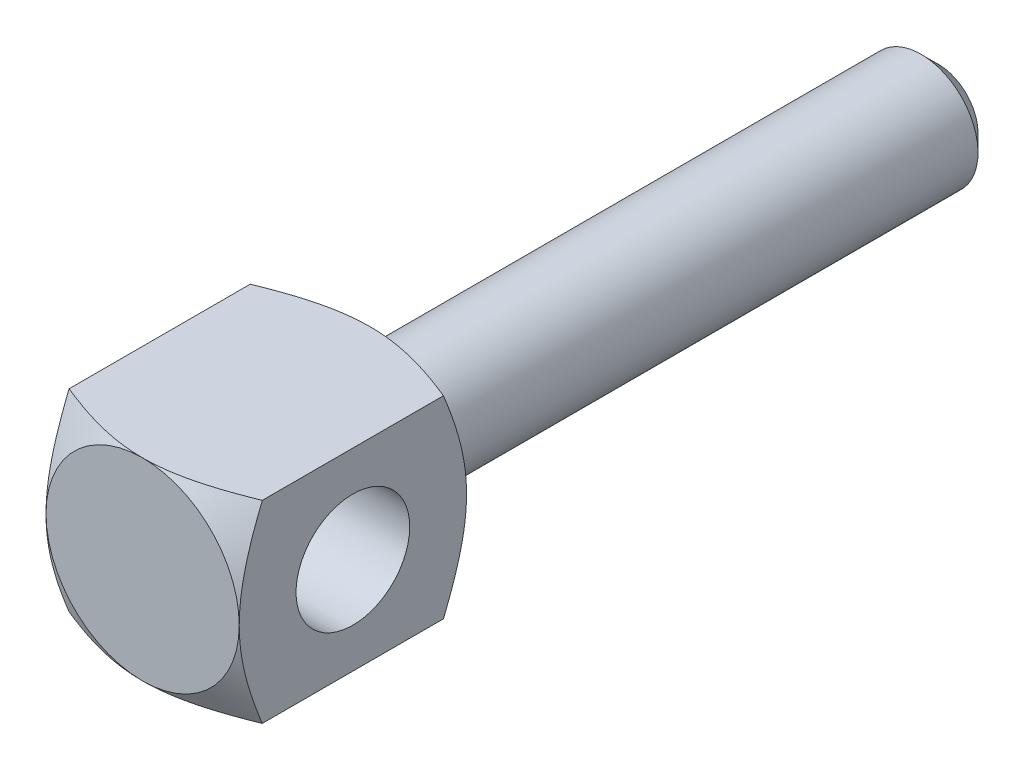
ISO-10303-21;
HEADER;
FILE_DESCRIPTION(('STEP AP214'),'2;1');
FILE_NAME('part.step','',(''),(''),'','','');
FILE_SCHEMA(('AUTOMOTIVE_DESIGN { 1 0 10303 214 1 1 1 1 }'));
ENDSEC;
DATA;
#1=APPLICATION_CONTEXT('core data for automotive mechanical design processes');
#2=APPLICATION_PROTOCOL_DEFINITION('international standard','automotive_design',2000,#1);
#3=PRODUCT_CONTEXT('',#1,'mechanical');
#4=PRODUCT('Part','Part','',(#3));
#5=PRODUCT_RELATED_PRODUCT_CATEGORY('part','',(#4));
#6=PRODUCT_DEFINITION_FORMATION('','',#4);
#7=PRODUCT_DEFINITION_CONTEXT('part definition',#1,'design');
#8=PRODUCT_DEFINITION('design','',#6,#7);
#9=PRODUCT_DEFINITION_SHAPE('','',#8);
#10=(LENGTH_UNIT() NAMED_UNIT(*) SI_UNIT(.MILLI.,.METRE.));
#11=(NAMED_UNIT(*) PLANE_ANGLE_UNIT() SI_UNIT($,.RADIAN.));
#12=(NAMED_UNIT(*) SI_UNIT($,.STERADIAN.) SOLID_ANGLE_UNIT());
#13=UNCERTAINTY_MEASURE_WITH_UNIT(LENGTH_MEASURE(1.E-05),#10,'distance_accuracy_value','');
#14=(GEOMETRIC_REPRESENTATION_CONTEXT(3) GLOBAL_UNCERTAINTY_ASSIGNED_CONTEXT((#13)) GLOBAL_UNIT_ASSIGNED_CONTEXT((#10,
#11,#12)) REPRESENTATION_CONTEXT('',''));
#15=CARTESIAN_POINT('',(0.,0.,0.));
#16=DIRECTION('',(0.,0.,1.));
#17=DIRECTION('',(1.,0.,0.));
#18=AXIS2_PLACEMENT_3D('',#15,#16,#17);
#19=CARTESIAN_POINT('',(0.,-5.,50.));
#20=DIRECTION('',(0.,0.,1.));
#21=DIRECTION('',(0.,-1.,0.));
#22=AXIS2_PLACEMENT_3D('',#19,#20,#21);
#23=PLANE('',#22);
#24=CARTESIAN_POINT('',(0.,0.,50.));
#25=DIRECTION('',(0.,0.,1.));
#26=DIRECTION('',(0.,-1.,0.));
#27=AXIS2_PLACEMENT_3D('',#24,#25,#26);
#28=CIRCLE('',#27,5.);
#29=CARTESIAN_POINT('',(0.,-5.,50.));
#30=VERTEX_POINT('',#29);
#31=EDGE_CURVE('E191',#30,#30,#28,.T.);
#32=ORIENTED_EDGE('',*,*,#31,.T.);
#33=EDGE_LOOP('',(#32));
#34=FACE_BOUND('',#33,.T.);
#35=CARTESIAN_POINT('',(0.,0.,50.));
#36=DIRECTION('',(0.,0.,1.));
#37=DIRECTION('',(0.,-1.,0.));
#38=AXIS2_PLACEMENT_3D('',#35,#36,#37);
#39=CIRCLE('',#38,8.5);
#40=CARTESIAN_POINT('',(0.,-8.5,50.));
#41=VERTEX_POINT('',#40);
#42=CARTESIAN_POINT('',(8.5,0.,50.));
#43=VERTEX_POINT('',#42);
#44=EDGE_CURVE('E82',#41,#43,#39,.T.);
#45=ORIENTED_EDGE('',*,*,#44,.F.);
#46=CARTESIAN_POINT('',(0.,0.,50.));
#47=DIRECTION('',(0.,0.,1.));
#48=DIRECTION('',(0.,-1.,0.));
#49=AXIS2_PLACEMENT_3D('',#46,#47,#48);
#50=CIRCLE('',#49,8.5);
#51=CARTESIAN_POINT('',(-8.5,0.,50.));
#52=VERTEX_POINT('',#51);
#53=EDGE_CURVE('E18',#52,#41,#50,.T.);
#54=ORIENTED_EDGE('',*,*,#53,.F.);
#55=CARTESIAN_POINT('',(0.,8.5,50.));
#56=VERTEX_POINT('',#55);
#57=EDGE_CURVE('E23',#56,#52,#50,.T.);
#58=ORIENTED_EDGE('',*,*,#57,.F.);
#59=EDGE_CURVE('E9',#43,#56,#50,.T.);
#60=ORIENTED_EDGE('',*,*,#59,.F.);
#61=EDGE_LOOP('',(#45,#54,#58,#60));
#62=FACE_BOUND('',#61,.T.);
#63=ADVANCED_FACE('F14',(#34,#62),#23,.F.);
#64=CARTESIAN_POINT('',(0.,0.,0.));
#65=DIRECTION('',(0.,0.,1.));
#66=DIRECTION('',(0.,-1.,0.));
#67=AXIS2_PLACEMENT_3D('',#64,#65,#66);
#68=PLANE('',#67);
#69=CARTESIAN_POINT('',(0.,0.,0.));
#70=DIRECTION('',(0.,0.,1.));
#71=DIRECTION('',(0.,-1.,0.));
#72=AXIS2_PLACEMENT_3D('',#69,#70,#71);
#73=CIRCLE('',#72,3.5);
#74=CARTESIAN_POINT('',(0.,-3.5,0.));
#75=VERTEX_POINT('',#74);
#76=EDGE_CURVE('E197',#75,#75,#73,.T.);
#77=ORIENTED_EDGE('',*,*,#76,.F.);
#78=EDGE_LOOP('',(#77));
#79=FACE_BOUND('',#78,.T.);
#80=ADVANCED_FACE('F16',(#79),#68,.F.);
#81=CARTESIAN_POINT('',(0.,0.,1.5));
#82=DIRECTION('',(0.,0.,1.));
#83=DIRECTION('',(0.,-1.,0.));
#84=AXIS2_PLACEMENT_3D('',#81,#82,#83);
#85=CONICAL_SURFACE('',#84,5.,0.785398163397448);
#86=ORIENTED_EDGE('',*,*,#76,.T.);
#87=EDGE_LOOP('',(#86));
#88=FACE_BOUND('',#87,.T.);
#89=CARTESIAN_POINT('',(0.,0.,1.5));
#90=DIRECTION('',(0.,0.,1.));
#91=DIRECTION('',(0.,-1.,0.));
#92=AXIS2_PLACEMENT_3D('',#89,#90,#91);
#93=CIRCLE('',#92,5.);
#94=CARTESIAN_POINT('',(0.,-5.,1.5));
#95=VERTEX_POINT('',#94);
#96=EDGE_CURVE('E194',#95,#95,#93,.T.);
#97=ORIENTED_EDGE('',*,*,#96,.F.);
#98=EDGE_LOOP('',(#97));
#99=FACE_BOUND('',#98,.T.);
#100=ADVANCED_FACE('F251',(#88,#99),#85,.T.);
#101=CARTESIAN_POINT('',(0.,0.,140.));
#102=DIRECTION('',(0.,0.,1.));
#103=DIRECTION('',(0.,-1.,0.));
#104=AXIS2_PLACEMENT_3D('',#101,#102,#103);
#105=CYLINDRICAL_SURFACE('',#104,5.);
#106=ORIENTED_EDGE('',*,*,#31,.F.);
#107=EDGE_LOOP('',(#106));
#108=FACE_BOUND('',#107,.T.);
#109=ORIENTED_EDGE('',*,*,#96,.T.);
#110=EDGE_LOOP('',(#109));
#111=FACE_BOUND('',#110,.T.);
#112=ADVANCED_FACE('F254',(#108,#111),#105,.T.);
#113=CARTESIAN_POINT('',(0.,0.,56.3709168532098));
#114=DIRECTION('',(0.,0.,1.));
#115=DIRECTION('',(0.,-1.,0.));
#116=AXIS2_PLACEMENT_3D('',#113,#114,#115);
#117=CONICAL_SURFACE('',#116,19.5347516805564,1.0471975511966);
#118=CARTESIAN_POINT('',(-16.9581422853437,-8.5,56.0443656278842));
#119=CARTESIAN_POINT('',(-16.5439778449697,-8.5,55.8306305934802));
#120=CARTESIAN_POINT('',(-16.1291936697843,-8.5,55.6180848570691));
#121=CARTESIAN_POINT('',(-15.2980643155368,-8.5,55.1960059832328));
#122=CARTESIAN_POINT('',(-14.8817190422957,-8.5,54.9864730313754));
#123=CARTESIAN_POINT('',(-14.0462488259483,-8.5,54.5706082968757));
#124=CARTESIAN_POINT('',(-13.6271197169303,-8.5,54.3642848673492));
#125=CARTESIAN_POINT('',(-12.7866363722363,-8.5,53.9562369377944));
#126=CARTESIAN_POINT('',(-12.3652821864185,-8.5,53.7545123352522));
#127=CARTESIAN_POINT('',(-11.4961277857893,-8.5,53.3456810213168));
#128=CARTESIAN_POINT('',(-11.0481703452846,-8.5,53.1389074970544));
#129=CARTESIAN_POINT('',(-10.1484580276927,-8.5,52.7336813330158));
#130=CARTESIAN_POINT('',(-9.69670291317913,-8.5,52.5352292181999));
#131=CARTESIAN_POINT('',(-8.78889276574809,-8.5,52.1494397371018));
#132=CARTESIAN_POINT('',(-8.33284167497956,-8.5,51.9620931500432));
#133=CARTESIAN_POINT('',(-7.41504845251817,-8.5,51.6019911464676));
#134=CARTESIAN_POINT('',(-6.95330722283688,-8.5,51.4292334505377));
#135=CARTESIAN_POINT('',(-6.02814854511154,-8.5,51.1051463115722));
#136=CARTESIAN_POINT('',(-5.56480940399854,-8.5,50.953596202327));
#137=CARTESIAN_POINT('',(-4.63038522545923,-8.5,50.6761276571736));
#138=CARTESIAN_POINT('',(-4.15929996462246,-8.5,50.5502099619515));
#139=CARTESIAN_POINT('',(-3.21846238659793,-8.5,50.3342322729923));
#140=CARTESIAN_POINT('',(-2.74886596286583,-8.5,50.2435159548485));
#141=CARTESIAN_POINT('',(-2.04001869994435,-8.5,50.137633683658));
#142=CARTESIAN_POINT('',(-1.80298698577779,-8.5,50.1073711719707));
#143=CARTESIAN_POINT('',(-1.327800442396,-8.5,50.0576847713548));
#144=CARTESIAN_POINT('',(-1.08964573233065,-8.5,50.0382597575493));
#145=CARTESIAN_POINT('',(-0.560607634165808,-8.5,50.0078316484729));
#146=CARTESIAN_POINT('',(-0.26955993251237,-8.5,49.9995918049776));
#147=CARTESIAN_POINT('',(0.31251560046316,-8.5,50.0004395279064));
#148=CARTESIAN_POINT('',(0.603543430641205,-8.5,50.0095277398));
#149=CARTESIAN_POINT('',(1.18462685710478,-8.5,50.0446201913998));
#150=CARTESIAN_POINT('',(1.47468223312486,-8.5,50.0706280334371));
#151=CARTESIAN_POINT('',(2.05292281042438,-8.5,50.1384551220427));
#152=CARTESIAN_POINT('',(2.34110795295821,-8.5,50.1802748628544));
#153=CARTESIAN_POINT('',(2.92302038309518,-8.5,50.2795128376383));
#154=CARTESIAN_POINT('',(3.216678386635,-8.5,50.3373331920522));
#155=CARTESIAN_POINT('',(3.80108558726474,-8.5,50.4660770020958));
#156=CARTESIAN_POINT('',(4.09183471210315,-8.5,50.5370007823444));
#157=CARTESIAN_POINT('',(4.67048877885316,-8.5,50.6900600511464));
#158=CARTESIAN_POINT('',(4.95839232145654,-8.5,50.7722007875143));
#159=CARTESIAN_POINT('',(5.531309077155,-8.5,50.9458962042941));
#160=CARTESIAN_POINT('',(5.81632245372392,-8.5,51.0374503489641));
#161=CARTESIAN_POINT('',(6.36070030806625,-8.5,51.2206992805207));
#162=CARTESIAN_POINT('',(6.62027208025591,-8.5,51.3117817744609));
#163=CARTESIAN_POINT('',(7.13736946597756,-8.5,51.4995946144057));
#164=CARTESIAN_POINT('',(7.39489498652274,-8.5,51.5963252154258));
#165=CARTESIAN_POINT('',(8.16481717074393,-8.5,51.8937035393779));
#166=CARTESIAN_POINT('',(8.6744526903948,-8.5,52.1015010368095));
#167=CARTESIAN_POINT('',(9.68831599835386,-8.5,52.5310502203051));
#168=CARTESIAN_POINT('',(10.1925381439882,-8.5,52.7528150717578));
#169=CARTESIAN_POINT('',(11.1963099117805,-8.5,53.2065007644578));
#170=CARTESIAN_POINT('',(11.6958600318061,-8.5,53.438420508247));
#171=CARTESIAN_POINT('',(12.6929546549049,-8.5,53.91067923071));
#172=CARTESIAN_POINT('',(13.1904872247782,-8.5,54.1510433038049));
#173=CARTESIAN_POINT('',(14.1826655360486,-8.5,54.6376710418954));
#174=CARTESIAN_POINT('',(14.677311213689,-8.5,54.883934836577));
#175=CARTESIAN_POINT('',(15.664016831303,-8.5,55.3809195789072));
#176=CARTESIAN_POINT('',(16.1560780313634,-8.5,55.6316380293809));
#177=CARTESIAN_POINT('',(17.1383225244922,-8.5,56.1367119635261));
#178=CARTESIAN_POINT('',(17.6285058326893,-8.5,56.3910674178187));
#179=CARTESIAN_POINT('',(18.9648231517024,-8.5,57.0895296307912));
#180=CARTESIAN_POINT('',(19.809440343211,-8.5,57.5365370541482));
#181=CARTESIAN_POINT('',(21.4955238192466,-8.5,58.4367490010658));
#182=CARTESIAN_POINT('',(22.3369895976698,-8.5,58.8899544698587));
#183=CARTESIAN_POINT('',(24.0118407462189,-8.5,59.7978046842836));
#184=CARTESIAN_POINT('',(24.8452424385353,-8.5,60.2524193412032));
#185=CARTESIAN_POINT('',(26.0938942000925,-8.5,60.9368101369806));
#186=CARTESIAN_POINT('',(26.5098330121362,-8.5,61.1653315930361));
#187=CARTESIAN_POINT('',(27.3413032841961,-8.5,61.6231128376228));
#188=CARTESIAN_POINT('',(27.7568347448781,-8.5,61.8523726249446));
#189=CARTESIAN_POINT('',(28.1721890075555,-8.5,62.0819530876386));
#190=B_SPLINE_CURVE_WITH_KNOTS('',3,(#118,#119,#120,#121,#122,#123,#124,#125,#126,#127,#128,
#129,#130,#131,#132,#133,#134,#135,#136,#137,#138,#139,#140,#141,#142,#143,#144,#145,#146,#147,
#148,#149,#150,#151,#152,#153,#154,#155,#156,#157,#158,#159,#160,#161,#162,#163,#164,#165,#166,
#167,#168,#169,#170,#171,#172,#173,#174,#175,#176,#177,#178,#179,#180,#181,#182,#183,#184,#185,
#186,#187,#188,#189),.UNSPECIFIED.,.F.,.F.,(4,2,2,2,2,2,2,2,2,2,2,2,2,2,2,2,2,2,2,2,2,2,2,2,2,2,
2,2,2,2,2,2,2,2,2,4),(0.,1.39819541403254,2.79647658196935,4.19793412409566,5.59936039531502,
7.07942729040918,8.55958741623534,10.0385008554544,11.517182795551,12.9791061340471,
14.4410717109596,15.8742935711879,16.5909475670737,17.307527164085,18.1804958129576,
19.0534969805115,19.9266840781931,20.7998984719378,21.6974410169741,22.5950058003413,
23.4929919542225,24.390927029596,25.2161165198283,26.0413432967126,27.6921353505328,
29.344507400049,30.9967013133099,32.6543082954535,34.3119517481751,35.9686935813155,
37.6254220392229,40.4922165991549,43.3594533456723,46.2074410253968,47.6311835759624,
49.0549237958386),.UNSPECIFIED.);
#191=CARTESIAN_POINT('',(-8.5,-8.5,52.0327436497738));
#192=VERTEX_POINT('',#191);
#193=EDGE_CURVE('E89',#41,#192,#190,.F.);
#194=ORIENTED_EDGE('',*,*,#193,.T.);
#195=CARTESIAN_POINT('',(-8.5,16.9581422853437,56.0443656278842));
#196=CARTESIAN_POINT('',(-8.5,16.5439778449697,55.8306305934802));
#197=CARTESIAN_POINT('',(-8.5,16.1291936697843,55.6180848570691));
#198=CARTESIAN_POINT('',(-8.5,15.2980643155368,55.1960059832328));
#199=CARTESIAN_POINT('',(-8.5,14.8817190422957,54.9864730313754));
#200=CARTESIAN_POINT('',(-8.5,14.0462488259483,54.5706082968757));
#201=CARTESIAN_POINT('',(-8.5,13.6271197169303,54.3642848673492));
#202=CARTESIAN_POINT('',(-8.5,12.7866363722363,53.9562369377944));
#203=CARTESIAN_POINT('',(-8.5,12.3652821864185,53.7545123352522));
#204=CARTESIAN_POINT('',(-8.5,11.4961277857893,53.3456810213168));
#205=CARTESIAN_POINT('',(-8.5,11.0481703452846,53.1389074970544));
#206=CARTESIAN_POINT('',(-8.5,10.1484580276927,52.7336813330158));
#207=CARTESIAN_POINT('',(-8.5,9.69670291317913,52.5352292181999));
#208=CARTESIAN_POINT('',(-8.5,8.78889276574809,52.1494397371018));
#209=CARTESIAN_POINT('',(-8.5,8.33284167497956,51.9620931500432));
#210=CARTESIAN_POINT('',(-8.5,7.41504845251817,51.6019911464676));
#211=CARTESIAN_POINT('',(-8.5,6.95330722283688,51.4292334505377));
#212=CARTESIAN_POINT('',(-8.5,6.02814854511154,51.1051463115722));
#213=CARTESIAN_POINT('',(-8.5,5.56480940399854,50.953596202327));
#214=CARTESIAN_POINT('',(-8.5,4.63038522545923,50.6761276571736));
#215=CARTESIAN_POINT('',(-8.5,4.15929996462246,50.5502099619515));
#216=CARTESIAN_POINT('',(-8.5,3.21846238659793,50.3342322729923));
#217=CARTESIAN_POINT('',(-8.5,2.74886596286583,50.2435159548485));
#218=CARTESIAN_POINT('',(-8.5,2.04001869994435,50.137633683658));
#219=CARTESIAN_POINT('',(-8.5,1.80298698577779,50.1073711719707));
#220=CARTESIAN_POINT('',(-8.5,1.327800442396,50.0576847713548));
#221=CARTESIAN_POINT('',(-8.5,1.08964573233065,50.0382597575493));
#222=CARTESIAN_POINT('',(-8.5,0.560607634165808,50.0078316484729));
#223=CARTESIAN_POINT('',(-8.5,0.26955993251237,49.9995918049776));
#224=CARTESIAN_POINT('',(-8.5,-0.31251560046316,50.0004395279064));
#225=CARTESIAN_POINT('',(-8.5,-0.603543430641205,50.0095277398));
#226=CARTESIAN_POINT('',(-8.5,-1.18462685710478,50.0446201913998));
#227=CARTESIAN_POINT('',(-8.5,-1.47468223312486,50.0706280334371));
#228=CARTESIAN_POINT('',(-8.5,-2.05292281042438,50.1384551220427));
#229=CARTESIAN_POINT('',(-8.5,-2.34110795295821,50.1802748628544));
#230=CARTESIAN_POINT('',(-8.5,-2.92302038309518,50.2795128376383));
#231=CARTESIAN_POINT('',(-8.5,-3.216678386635,50.3373331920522));
#232=CARTESIAN_POINT('',(-8.5,-3.80108558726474,50.4660770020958));
#233=CARTESIAN_POINT('',(-8.5,-4.09183471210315,50.5370007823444));
#234=CARTESIAN_POINT('',(-8.5,-4.67048877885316,50.6900600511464));
#235=CARTESIAN_POINT('',(-8.5,-4.95839232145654,50.7722007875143));
#236=CARTESIAN_POINT('',(-8.5,-5.531309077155,50.9458962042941));
#237=CARTESIAN_POINT('',(-8.5,-5.81632245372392,51.0374503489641));
#238=CARTESIAN_POINT('',(-8.5,-6.36070030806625,51.2206992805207));
#239=CARTESIAN_POINT('',(-8.5,-6.62027208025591,51.3117817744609));
#240=CARTESIAN_POINT('',(-8.5,-7.13736946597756,51.4995946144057));
#241=CARTESIAN_POINT('',(-8.5,-7.39489498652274,51.5963252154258));
#242=CARTESIAN_POINT('',(-8.5,-8.16481717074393,51.8937035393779));
#243=CARTESIAN_POINT('',(-8.5,-8.6744526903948,52.1015010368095));
#244=CARTESIAN_POINT('',(-8.5,-9.68831599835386,52.5310502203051));
#245=CARTESIAN_POINT('',(-8.5,-10.1925381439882,52.7528150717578));
#246=CARTESIAN_POINT('',(-8.5,-11.1963099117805,53.2065007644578));
#247=CARTESIAN_POINT('',(-8.5,-11.6958600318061,53.438420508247));
#248=CARTESIAN_POINT('',(-8.5,-12.6929546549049,53.91067923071));
#249=CARTESIAN_POINT('',(-8.5,-13.1904872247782,54.1510433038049));
#250=CARTESIAN_POINT('',(-8.5,-14.1826655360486,54.6376710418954));
#251=CARTESIAN_POINT('',(-8.5,-14.677311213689,54.883934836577));
#252=CARTESIAN_POINT('',(-8.5,-15.664016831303,55.3809195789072));
#253=CARTESIAN_POINT('',(-8.5,-16.1560780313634,55.6316380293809));
#254=CARTESIAN_POINT('',(-8.5,-17.1383225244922,56.1367119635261));
#255=CARTESIAN_POINT('',(-8.5,-17.6285058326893,56.3910674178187));
#256=CARTESIAN_POINT('',(-8.5,-18.9648231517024,57.0895296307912));
#257=CARTESIAN_POINT('',(-8.5,-19.809440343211,57.5365370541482));
#258=CARTESIAN_POINT('',(-8.5,-21.4955238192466,58.4367490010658));
#259=CARTESIAN_POINT('',(-8.5,-22.3369895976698,58.8899544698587));
#260=CARTESIAN_POINT('',(-8.5,-24.0118407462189,59.7978046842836));
#261=CARTESIAN_POINT('',(-8.5,-24.8452424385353,60.2524193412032));
#262=CARTESIAN_POINT('',(-8.5,-26.0938942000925,60.9368101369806));
#263=CARTESIAN_POINT('',(-8.5,-26.5098330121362,61.1653315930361));
#264=CARTESIAN_POINT('',(-8.5,-27.3413032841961,61.6231128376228));
#265=CARTESIAN_POINT('',(-8.5,-27.7568347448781,61.8523726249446));
#266=CARTESIAN_POINT('',(-8.5,-28.1721890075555,62.0819530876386));
#267=B_SPLINE_CURVE_WITH_KNOTS('',3,(#195,#196,#197,#198,#199,#200,#201,#202,#203,#204,#205,
#206,#207,#208,#209,#210,#211,#212,#213,#214,#215,#216,#217,#218,#219,#220,#221,#222,#223,#224,
#225,#226,#227,#228,#229,#230,#231,#232,#233,#234,#235,#236,#237,#238,#239,#240,#241,#242,#243,
#244,#245,#246,#247,#248,#249,#250,#251,#252,#253,#254,#255,#256,#257,#258,#259,#260,#261,#262,
#263,#264,#265,#266),.UNSPECIFIED.,.F.,.F.,(4,2,2,2,2,2,2,2,2,2,2,2,2,2,2,2,2,2,2,2,2,2,2,2,2,2,
2,2,2,2,2,2,2,2,2,4),(0.,1.39819541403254,2.79647658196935,4.19793412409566,5.59936039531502,
7.07942729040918,8.55958741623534,10.0385008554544,11.517182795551,12.9791061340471,
14.4410717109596,15.8742935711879,16.5909475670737,17.307527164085,18.1804958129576,
19.0534969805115,19.9266840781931,20.7998984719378,21.6974410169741,22.5950058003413,
23.4929919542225,24.390927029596,25.2161165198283,26.0413432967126,27.6921353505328,
29.344507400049,30.9967013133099,32.6543082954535,34.3119517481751,35.9686935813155,
37.6254220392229,40.4922165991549,43.3594533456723,46.2074410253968,47.6311835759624,
49.0549237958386),.UNSPECIFIED.);
#268=EDGE_CURVE('E96',#52,#192,#267,.T.);
#269=ORIENTED_EDGE('',*,*,#268,.F.);
#270=ORIENTED_EDGE('',*,*,#53,.T.);
#271=EDGE_LOOP('',(#194,#269,#270));
#272=FACE_BOUND('',#271,.T.);
#273=ADVANCED_FACE('F94',(#272),#117,.T.);
#274=ORIENTED_EDGE('',*,*,#57,.T.);
#275=CARTESIAN_POINT('',(-8.5,8.5,52.0327436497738));
#276=VERTEX_POINT('',#275);
#277=EDGE_CURVE('E106',#276,#52,#267,.T.);
#278=ORIENTED_EDGE('',*,*,#277,.F.);
#279=CARTESIAN_POINT('',(-16.9581422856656,8.5,56.0443656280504));
#280=CARTESIAN_POINT('',(-16.5439778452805,8.5,55.8306305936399));
#281=CARTESIAN_POINT('',(-16.129193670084,8.5,55.6180848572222));
#282=CARTESIAN_POINT('',(-15.2980643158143,8.5,55.1960059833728));
#283=CARTESIAN_POINT('',(-14.881719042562,8.5,54.9864730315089));
#284=CARTESIAN_POINT('',(-14.0462488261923,8.5,54.5706082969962));
#285=CARTESIAN_POINT('',(-13.6271197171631,8.5,54.3642848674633));
#286=CARTESIAN_POINT('',(-12.7866363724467,8.5,53.9562369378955));
#287=CARTESIAN_POINT('',(-12.3652821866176,8.5,53.7545123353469));
#288=CARTESIAN_POINT('',(-11.4961277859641,8.5,53.3456810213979));
#289=CARTESIAN_POINT('',(-11.0481703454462,8.5,53.1389074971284));
#290=CARTESIAN_POINT('',(-10.1484580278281,8.5,52.7336813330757));
#291=CARTESIAN_POINT('',(-9.69670291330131,8.5,52.5352292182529));
#292=CARTESIAN_POINT('',(-8.78889276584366,8.5,52.1494397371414));
#293=CARTESIAN_POINT('',(-8.33284167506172,8.5,51.9620931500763));
#294=CARTESIAN_POINT('',(-7.41504845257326,8.5,51.6019911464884));
#295=CARTESIAN_POINT('',(-6.95330722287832,8.5,51.4292334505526));
#296=CARTESIAN_POINT('',(-6.0281485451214,8.5,51.1051463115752));
#297=CARTESIAN_POINT('',(-5.56480940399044,8.5,50.9535962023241));
#298=CARTESIAN_POINT('',(-4.63038522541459,8.5,50.6761276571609));
#299=CARTESIAN_POINT('',(-4.15929996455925,8.5,50.550209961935));
#300=CARTESIAN_POINT('',(-3.21846238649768,8.5,50.3342322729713));
#301=CARTESIAN_POINT('',(-2.74886596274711,8.5,50.2435159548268));
#302=CARTESIAN_POINT('',(-2.04001869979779,8.5,50.1376336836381));
#303=CARTESIAN_POINT('',(-1.80298698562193,8.5,50.1073711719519));
#304=CARTESIAN_POINT('',(-1.32780044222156,8.5,50.0576847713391));
#305=CARTESIAN_POINT('',(-1.08964573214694,8.5,50.0382597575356));
#306=CARTESIAN_POINT('',(-0.56060763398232,8.5,50.0078316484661));
#307=CARTESIAN_POINT('',(-0.269559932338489,8.5,49.9995918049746));
#308=CARTESIAN_POINT('',(0.312515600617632,8.5,50.0004395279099));
#309=CARTESIAN_POINT('',(0.603543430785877,8.5,50.0095277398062));
#310=CARTESIAN_POINT('',(1.18462685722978,8.5,50.0446201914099));
#311=CARTESIAN_POINT('',(1.47468223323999,8.5,50.0706280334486));
#312=CARTESIAN_POINT('',(2.05292281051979,8.5,50.1384551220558));
#313=CARTESIAN_POINT('',(2.34110795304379,8.5,50.1802748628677));
#314=CARTESIAN_POINT('',(2.92302038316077,8.5,50.2795128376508));
#315=CARTESIAN_POINT('',(3.21667838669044,8.5,50.3373331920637));
#316=CARTESIAN_POINT('',(3.80108558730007,8.5,50.4660770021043));
#317=CARTESIAN_POINT('',(4.09183471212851,8.5,50.5370007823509));
#318=CARTESIAN_POINT('',(4.67048877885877,8.5,50.6900600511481));
#319=CARTESIAN_POINT('',(4.95839232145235,8.5,50.7722007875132));
#320=CARTESIAN_POINT('',(5.53130907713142,8.5,50.9458962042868));
#321=CARTESIAN_POINT('',(5.81632245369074,8.5,51.0374503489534));
#322=CARTESIAN_POINT('',(6.36070030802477,8.5,51.2206992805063));
#323=CARTESIAN_POINT('',(6.62027208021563,8.5,51.3117817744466));
#324=CARTESIAN_POINT('',(7.13736946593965,8.5,51.4995946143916));
#325=CARTESIAN_POINT('',(7.39489498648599,8.5,51.5963252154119));
#326=CARTESIAN_POINT('',(8.16481717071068,8.5,51.8937035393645));
#327=CARTESIAN_POINT('',(8.67445269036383,8.5,52.1015010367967));
#328=CARTESIAN_POINT('',(9.68831599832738,8.5,52.5310502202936));
#329=CARTESIAN_POINT('',(10.1925381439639,8.5,52.752815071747));
#330=CARTESIAN_POINT('',(11.1963099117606,8.5,53.2065007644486));
#331=CARTESIAN_POINT('',(11.6958600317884,8.5,53.4384205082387));
#332=CARTESIAN_POINT('',(12.6929546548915,8.5,53.9106792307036));
#333=CARTESIAN_POINT('',(13.1904872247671,8.5,54.1510433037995));
#334=CARTESIAN_POINT('',(14.1826655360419,8.5,54.637671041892));
#335=CARTESIAN_POINT('',(14.6773112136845,8.5,54.8839348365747));
#336=CARTESIAN_POINT('',(15.6640168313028,8.5,55.3809195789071));
#337=CARTESIAN_POINT('',(16.1560780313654,8.5,55.6316380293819));
#338=CARTESIAN_POINT('',(17.1383225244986,8.5,56.1367119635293));
#339=CARTESIAN_POINT('',(17.6285058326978,8.5,56.3910674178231));
#340=CARTESIAN_POINT('',(18.9648231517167,8.5,57.0895296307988));
#341=CARTESIAN_POINT('',(19.8094403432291,8.5,57.5365370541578));
#342=CARTESIAN_POINT('',(21.4955238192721,8.5,58.4367490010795));
#343=CARTESIAN_POINT('',(22.336989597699,8.5,58.8899544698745));
#344=CARTESIAN_POINT('',(24.0118407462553,8.5,59.7978046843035));
#345=CARTESIAN_POINT('',(24.8452424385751,8.5,60.252419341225));
#346=CARTESIAN_POINT('',(26.0938942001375,8.5,60.9368101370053));
#347=CARTESIAN_POINT('',(26.509833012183,8.5,61.1653315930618));
#348=CARTESIAN_POINT('',(27.3413032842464,8.5,61.6231128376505));
#349=CARTESIAN_POINT('',(27.75683474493,8.5,61.8523726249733));
#350=CARTESIAN_POINT('',(28.1721890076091,8.5,62.0819530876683));
#351=B_SPLINE_CURVE_WITH_KNOTS('',3,(#279,#280,#281,#282,#283,#284,#285,#286,#287,#288,#289,
#290,#291,#292,#293,#294,#295,#296,#297,#298,#299,#300,#301,#302,#303,#304,#305,#306,#307,#308,
#309,#310,#311,#312,#313,#314,#315,#316,#317,#318,#319,#320,#321,#322,#323,#324,#325,#326,#327,
#328,#329,#330,#331,#332,#333,#334,#335,#336,#337,#338,#339,#340,#341,#342,#343,#344,#345,#346,
#347,#348,#349,#350),.UNSPECIFIED.,.F.,.F.,(4,2,2,2,2,2,2,2,2,2,2,2,2,2,2,2,2,2,2,2,2,2,2,2,2,2,
2,2,2,2,2,2,2,2,2,4),(0.,1.39819541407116,2.7964765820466,4.19793412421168,5.59936039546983,
7.0794272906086,8.55958741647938,10.038500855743,11.5171827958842,12.9791061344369,
14.4410717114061,15.8742935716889,16.590947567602,17.3075271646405,18.1804958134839,
19.0534969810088,19.9266840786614,20.799898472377,21.6974410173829,22.5950058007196,
23.4929919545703,24.3909270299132,25.2161165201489,26.0413432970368,27.6921353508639,
29.344507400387,30.9967013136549,32.6543082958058,34.3119517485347,35.9686935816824,
37.6254220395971,40.4922165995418,43.3594533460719,46.2074410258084,47.63118357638,
49.0549237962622),.UNSPECIFIED.);
#352=EDGE_CURVE('E37',#56,#276,#351,.F.);
#353=ORIENTED_EDGE('',*,*,#352,.F.);
#354=EDGE_LOOP('',(#274,#278,#353));
#355=FACE_BOUND('',#354,.T.);
#356=ADVANCED_FACE('F126',(#355),#117,.T.);
#357=CARTESIAN_POINT('',(8.5,16.9581422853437,56.0443656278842));
#358=CARTESIAN_POINT('',(8.5,16.5439778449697,55.8306305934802));
#359=CARTESIAN_POINT('',(8.5,16.1291936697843,55.6180848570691));
#360=CARTESIAN_POINT('',(8.5,15.2980643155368,55.1960059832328));
#361=CARTESIAN_POINT('',(8.5,14.8817190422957,54.9864730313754));
#362=CARTESIAN_POINT('',(8.5,14.0462488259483,54.5706082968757));
#363=CARTESIAN_POINT('',(8.5,13.6271197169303,54.3642848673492));
#364=CARTESIAN_POINT('',(8.5,12.7866363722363,53.9562369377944));
#365=CARTESIAN_POINT('',(8.5,12.3652821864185,53.7545123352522));
#366=CARTESIAN_POINT('',(8.5,11.4961277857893,53.3456810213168));
#367=CARTESIAN_POINT('',(8.5,11.0481703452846,53.1389074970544));
#368=CARTESIAN_POINT('',(8.5,10.1484580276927,52.7336813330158));
#369=CARTESIAN_POINT('',(8.5,9.69670291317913,52.5352292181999));
#370=CARTESIAN_POINT('',(8.5,8.78889276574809,52.1494397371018));
#371=CARTESIAN_POINT('',(8.5,8.33284167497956,51.9620931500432));
#372=CARTESIAN_POINT('',(8.5,7.41504845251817,51.6019911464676));
#373=CARTESIAN_POINT('',(8.5,6.95330722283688,51.4292334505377));
#374=CARTESIAN_POINT('',(8.5,6.02814854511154,51.1051463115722));
#375=CARTESIAN_POINT('',(8.5,5.56480940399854,50.953596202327));
#376=CARTESIAN_POINT('',(8.5,4.63038522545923,50.6761276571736));
#377=CARTESIAN_POINT('',(8.5,4.15929996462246,50.5502099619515));
#378=CARTESIAN_POINT('',(8.5,3.21846238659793,50.3342322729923));
#379=CARTESIAN_POINT('',(8.5,2.74886596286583,50.2435159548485));
#380=CARTESIAN_POINT('',(8.5,2.04001869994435,50.137633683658));
#381=CARTESIAN_POINT('',(8.5,1.80298698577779,50.1073711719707));
#382=CARTESIAN_POINT('',(8.5,1.327800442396,50.0576847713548));
#383=CARTESIAN_POINT('',(8.5,1.08964573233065,50.0382597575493));
#384=CARTESIAN_POINT('',(8.5,0.560607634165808,50.0078316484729));
#385=CARTESIAN_POINT('',(8.5,0.26955993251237,49.9995918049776));
#386=CARTESIAN_POINT('',(8.5,-0.31251560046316,50.0004395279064));
#387=CARTESIAN_POINT('',(8.5,-0.603543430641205,50.0095277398));
#388=CARTESIAN_POINT('',(8.5,-1.18462685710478,50.0446201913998));
#389=CARTESIAN_POINT('',(8.5,-1.47468223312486,50.0706280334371));
#390=CARTESIAN_POINT('',(8.5,-2.05292281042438,50.1384551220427));
#391=CARTESIAN_POINT('',(8.5,-2.34110795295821,50.1802748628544));
#392=CARTESIAN_POINT('',(8.5,-2.92302038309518,50.2795128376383));
#393=CARTESIAN_POINT('',(8.5,-3.216678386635,50.3373331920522));
#394=CARTESIAN_POINT('',(8.5,-3.80108558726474,50.4660770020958));
#395=CARTESIAN_POINT('',(8.5,-4.09183471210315,50.5370007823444));
#396=CARTESIAN_POINT('',(8.5,-4.67048877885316,50.6900600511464));
#397=CARTESIAN_POINT('',(8.5,-4.95839232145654,50.7722007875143));
#398=CARTESIAN_POINT('',(8.5,-5.531309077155,50.9458962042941));
#399=CARTESIAN_POINT('',(8.5,-5.81632245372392,51.0374503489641));
#400=CARTESIAN_POINT('',(8.5,-6.36070030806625,51.2206992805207));
#401=CARTESIAN_POINT('',(8.5,-6.62027208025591,51.3117817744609));
#402=CARTESIAN_POINT('',(8.5,-7.13736946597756,51.4995946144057));
#403=CARTESIAN_POINT('',(8.5,-7.39489498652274,51.5963252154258));
#404=CARTESIAN_POINT('',(8.5,-8.16481717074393,51.8937035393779));
#405=CARTESIAN_POINT('',(8.5,-8.6744526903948,52.1015010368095));
#406=CARTESIAN_POINT('',(8.5,-9.68831599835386,52.5310502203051));
#407=CARTESIAN_POINT('',(8.5,-10.1925381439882,52.7528150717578));
#408=CARTESIAN_POINT('',(8.5,-11.1963099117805,53.2065007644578));
#409=CARTESIAN_POINT('',(8.5,-11.6958600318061,53.438420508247));
#410=CARTESIAN_POINT('',(8.5,-12.6929546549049,53.91067923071));
#411=CARTESIAN_POINT('',(8.5,-13.1904872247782,54.1510433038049));
#412=CARTESIAN_POINT('',(8.5,-14.1826655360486,54.6376710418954));
#413=CARTESIAN_POINT('',(8.5,-14.677311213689,54.883934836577));
#414=CARTESIAN_POINT('',(8.5,-15.664016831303,55.3809195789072));
#415=CARTESIAN_POINT('',(8.5,-16.1560780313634,55.6316380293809));
#416=CARTESIAN_POINT('',(8.5,-17.1383225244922,56.1367119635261));
#417=CARTESIAN_POINT('',(8.5,-17.6285058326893,56.3910674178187));
#418=CARTESIAN_POINT('',(8.5,-18.9648231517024,57.0895296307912));
#419=CARTESIAN_POINT('',(8.5,-19.809440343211,57.5365370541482));
#420=CARTESIAN_POINT('',(8.5,-21.4955238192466,58.4367490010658));
#421=CARTESIAN_POINT('',(8.5,-22.3369895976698,58.8899544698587));
#422=CARTESIAN_POINT('',(8.5,-24.0118407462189,59.7978046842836));
#423=CARTESIAN_POINT('',(8.5,-24.8452424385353,60.2524193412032));
#424=CARTESIAN_POINT('',(8.5,-26.0938942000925,60.9368101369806));
#425=CARTESIAN_POINT('',(8.5,-26.5098330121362,61.1653315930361));
#426=CARTESIAN_POINT('',(8.5,-27.3413032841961,61.6231128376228));
#427=CARTESIAN_POINT('',(8.5,-27.7568347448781,61.8523726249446));
#428=CARTESIAN_POINT('',(8.5,-28.1721890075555,62.0819530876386));
#429=B_SPLINE_CURVE_WITH_KNOTS('',3,(#357,#358,#359,#360,#361,#362,#363,#364,#365,#366,#367,
#368,#369,#370,#371,#372,#373,#374,#375,#376,#377,#378,#379,#380,#381,#382,#383,#384,#385,#386,
#387,#388,#389,#390,#391,#392,#393,#394,#395,#396,#397,#398,#399,#400,#401,#402,#403,#404,#405,
#406,#407,#408,#409,#410,#411,#412,#413,#414,#415,#416,#417,#418,#419,#420,#421,#422,#423,#424,
#425,#426,#427,#428),.UNSPECIFIED.,.F.,.F.,(4,2,2,2,2,2,2,2,2,2,2,2,2,2,2,2,2,2,2,2,2,2,2,2,2,2,
2,2,2,2,2,2,2,2,2,4),(0.,1.39819541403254,2.79647658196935,4.19793412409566,5.59936039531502,
7.07942729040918,8.55958741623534,10.0385008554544,11.517182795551,12.9791061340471,
14.4410717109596,15.8742935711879,16.5909475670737,17.307527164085,18.1804958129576,
19.0534969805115,19.9266840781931,20.7998984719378,21.6974410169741,22.5950058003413,
23.4929919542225,24.390927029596,25.2161165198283,26.0413432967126,27.6921353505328,
29.344507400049,30.9967013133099,32.6543082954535,34.3119517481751,35.9686935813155,
37.6254220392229,40.4922165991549,43.3594533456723,46.2074410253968,47.6311835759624,
49.0549237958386),.UNSPECIFIED.);
#430=CARTESIAN_POINT('',(8.5,8.5,52.0327436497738));
#431=VERTEX_POINT('',#430);
#432=EDGE_CURVE('E29',#431,#43,#429,.T.);
#433=ORIENTED_EDGE('',*,*,#432,.T.);
#434=ORIENTED_EDGE('',*,*,#59,.T.);
#435=EDGE_CURVE('E223',#431,#56,#351,.F.);
#436=ORIENTED_EDGE('',*,*,#435,.F.);
#437=EDGE_LOOP('',(#433,#434,#436));
#438=FACE_BOUND('',#437,.T.);
#439=ADVANCED_FACE('F290',(#438),#117,.T.);
#440=CARTESIAN_POINT('',(8.5,-8.5,52.0327436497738));
#441=VERTEX_POINT('',#440);
#442=EDGE_CURVE('E85',#43,#441,#429,.T.);
#443=ORIENTED_EDGE('',*,*,#442,.T.);
#444=EDGE_CURVE('E78',#441,#41,#190,.F.);
#445=ORIENTED_EDGE('',*,*,#444,.T.);
#446=ORIENTED_EDGE('',*,*,#44,.T.);
#447=EDGE_LOOP('',(#443,#445,#446));
#448=FACE_BOUND('',#447,.T.);
#449=ADVANCED_FACE('F80',(#448),#117,.T.);
#450=CARTESIAN_POINT('',(0.,-13.,70.));
#451=DIRECTION('',(0.,0.,-1.));
#452=DIRECTION('',(0.,1.,0.));
#453=AXIS2_PLACEMENT_3D('',#450,#451,#452);
#454=PLANE('',#453);
#455=CARTESIAN_POINT('',(0.,0.,70.));
#456=DIRECTION('',(0.,0.,-1.));
#457=DIRECTION('',(0.,1.,0.));
#458=AXIS2_PLACEMENT_3D('',#455,#456,#457);
#459=CIRCLE('',#458,8.5);
#460=CARTESIAN_POINT('',(0.,8.5,70.));
#461=VERTEX_POINT('',#460);
#462=CARTESIAN_POINT('',(8.5,0.,70.));
#463=VERTEX_POINT('',#462);
#464=EDGE_CURVE('E100',#461,#463,#459,.T.);
#465=ORIENTED_EDGE('',*,*,#464,.F.);
#466=CARTESIAN_POINT('',(-8.5,0.,70.));
#467=VERTEX_POINT('',#466);
#468=EDGE_CURVE('E200',#467,#461,#459,.T.);
#469=ORIENTED_EDGE('',*,*,#468,.F.);
#470=CARTESIAN_POINT('',(0.,-8.5,70.));
#471=VERTEX_POINT('',#470);
#472=EDGE_CURVE('E203',#471,#467,#459,.T.);
#473=ORIENTED_EDGE('',*,*,#472,.F.);
#474=CARTESIAN_POINT('',(0.,0.,70.));
#475=DIRECTION('',(0.,0.,1.));
#476=DIRECTION('',(0.,-1.,0.));
#477=AXIS2_PLACEMENT_3D('',#474,#475,#476);
#478=CIRCLE('',#477,8.5);
#479=EDGE_CURVE('E218',#471,#463,#478,.T.);
#480=ORIENTED_EDGE('',*,*,#479,.T.);
#481=EDGE_LOOP('',(#465,#469,#473,#480));
#482=FACE_BOUND('',#481,.T.);
#483=ADVANCED_FACE('F219',(#482),#454,.F.);
#484=CARTESIAN_POINT('',(0.,0.,70.));
#485=DIRECTION('',(0.,0.,-1.));
#486=DIRECTION('',(0.,1.,0.));
#487=AXIS2_PLACEMENT_3D('',#484,#485,#486);
#488=CONICAL_SURFACE('',#487,8.5,1.0471975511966);
#489=CARTESIAN_POINT('',(8.5,16.9962238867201,63.935974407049));
#490=CARTESIAN_POINT('',(8.5,16.5815425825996,64.1500725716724));
#491=CARTESIAN_POINT('',(8.5,16.1662431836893,64.3629850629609));
#492=CARTESIAN_POINT('',(8.5,15.334087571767,64.7858068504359));
#493=CARTESIAN_POINT('',(8.5,14.9172312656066,64.9957159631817));
#494=CARTESIAN_POINT('',(8.5,14.0807498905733,65.4123419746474));
#495=CARTESIAN_POINT('',(8.5,13.6611206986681,65.619050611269));
#496=CARTESIAN_POINT('',(8.5,12.8196428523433,66.027884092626));
#497=CARTESIAN_POINT('',(8.5,12.3977942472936,66.2300090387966));
#498=CARTESIAN_POINT('',(8.5,11.5275738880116,66.6397097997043));
#499=CARTESIAN_POINT('',(8.5,11.079044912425,66.8469527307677));
#500=CARTESIAN_POINT('',(8.5,10.1781971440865,67.2531432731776));
#501=CARTESIAN_POINT('',(8.5,9.72587811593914,67.4520903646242));
#502=CARTESIAN_POINT('',(8.5,8.81694546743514,67.8389034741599));
#503=CARTESIAN_POINT('',(8.5,8.36033575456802,68.026778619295));
#504=CARTESIAN_POINT('',(8.5,7.4414308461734,68.3879790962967));
#505=CARTESIAN_POINT('',(8.5,6.97913654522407,68.5613066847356));
#506=CARTESIAN_POINT('',(8.5,6.0528977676,68.8865692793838));
#507=CARTESIAN_POINT('',(8.5,5.58903187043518,69.0387251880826));
#508=CARTESIAN_POINT('',(8.5,4.65354288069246,69.3174578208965));
#509=CARTESIAN_POINT('',(8.5,4.18191954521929,69.4440337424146));
#510=CARTESIAN_POINT('',(8.5,3.24001451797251,69.6613456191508));
#511=CARTESIAN_POINT('',(8.5,2.76988979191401,69.7527391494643));
#512=CARTESIAN_POINT('',(8.5,2.06021110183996,69.8596337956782));
#513=CARTESIAN_POINT('',(8.5,1.82289584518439,69.8902331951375));
#514=CARTESIAN_POINT('',(8.5,1.34712745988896,69.9405831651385));
#515=CARTESIAN_POINT('',(8.5,1.10867445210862,69.9603348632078));
#516=CARTESIAN_POINT('',(8.5,0.578393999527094,69.9914984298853));
#517=CARTESIAN_POINT('',(8.5,0.286396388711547,70.0001093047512));
#518=CARTESIAN_POINT('',(8.5,-0.297597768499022,69.9998885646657));
#519=CARTESIAN_POINT('',(8.5,-0.589594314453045,69.9910563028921));
#520=CARTESIAN_POINT('',(8.5,-1.17262200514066,69.9563520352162));
#521=CARTESIAN_POINT('',(8.5,-1.46365293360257,69.9304764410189));
#522=CARTESIAN_POINT('',(8.5,-2.04384062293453,69.862793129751));
#523=CARTESIAN_POINT('',(8.5,-2.33299732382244,69.8209849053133));
#524=CARTESIAN_POINT('',(8.5,-2.91689554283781,69.7216555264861));
#525=CARTESIAN_POINT('',(8.5,-3.21156716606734,69.6637277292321));
#526=CARTESIAN_POINT('',(8.5,-3.79798256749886,69.534670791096));
#527=CARTESIAN_POINT('',(8.5,-4.08972627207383,69.46354131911));
#528=CARTESIAN_POINT('',(8.5,-4.67035321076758,69.3099913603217));
#529=CARTESIAN_POINT('',(8.5,-4.95923499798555,69.227565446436));
#530=CARTESIAN_POINT('',(8.5,-5.53408894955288,69.0532391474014));
#531=CARTESIAN_POINT('',(8.5,-5.82006127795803,68.9613392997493));
#532=CARTESIAN_POINT('',(8.5,-6.36528358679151,68.7777129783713));
#533=CARTESIAN_POINT('',(8.5,-6.62475065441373,68.6866273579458));
#534=CARTESIAN_POINT('',(8.5,-7.14164119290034,68.4988175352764));
#535=CARTESIAN_POINT('',(8.5,-7.39906457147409,68.4020930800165));
#536=CARTESIAN_POINT('',(8.5,-8.16868348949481,68.1047445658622));
#537=CARTESIAN_POINT('',(8.5,-8.67812141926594,67.8969819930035));
#538=CARTESIAN_POINT('',(8.5,-9.69159529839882,67.4675228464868));
#539=CARTESIAN_POINT('',(8.5,-10.1956256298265,67.2458131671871));
#540=CARTESIAN_POINT('',(8.5,-11.1990194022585,66.7922507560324));
#541=CARTESIAN_POINT('',(8.5,-11.698383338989,66.5603991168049));
#542=CARTESIAN_POINT('',(8.5,-12.6950992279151,66.08829017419));
#543=CARTESIAN_POINT('',(8.5,-13.192439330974,65.8480079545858));
#544=CARTESIAN_POINT('',(8.5,-14.1842356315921,65.3615501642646));
#545=CARTESIAN_POINT('',(8.5,-14.6786917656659,65.1153744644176));
#546=CARTESIAN_POINT('',(8.5,-15.66502131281,64.6185698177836));
#547=CARTESIAN_POINT('',(8.5,-16.156895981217,64.3679433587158));
#548=CARTESIAN_POINT('',(8.5,-17.1387689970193,63.8630564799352));
#549=CARTESIAN_POINT('',(8.5,-17.628767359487,63.6087960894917));
#550=CARTESIAN_POINT('',(8.5,-18.9645480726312,62.9106137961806));
#551=CARTESIAN_POINT('',(8.5,-19.8088149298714,62.4637937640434));
#552=CARTESIAN_POINT('',(8.5,-21.4941996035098,61.5639610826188));
#553=CARTESIAN_POINT('',(8.5,-22.3353169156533,61.1109474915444));
#554=CARTESIAN_POINT('',(8.5,-24.0094959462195,60.2034709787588));
#555=CARTESIAN_POINT('',(8.5,-24.8425739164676,59.7490380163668));
#556=CARTESIAN_POINT('',(8.5,-26.0907409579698,59.064920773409));
#557=CARTESIAN_POINT('',(8.5,-26.5065184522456,58.8364906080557));
#558=CARTESIAN_POINT('',(8.5,-27.3376662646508,58.3788922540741));
#559=CARTESIAN_POINT('',(8.5,-27.7530365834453,58.1497240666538));
#560=CARTESIAN_POINT('',(8.5,-28.1682297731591,57.9202353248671));
#561=B_SPLINE_CURVE_WITH_KNOTS('',3,(#489,#490,#491,#492,#493,#494,#495,#496,#497,#498,#499,
#500,#501,#502,#503,#504,#505,#506,#507,#508,#509,#510,#511,#512,#513,#514,#515,#516,#517,#518,
#519,#520,#521,#522,#523,#524,#525,#526,#527,#528,#529,#530,#531,#532,#533,#534,#535,#536,#537,
#538,#539,#540,#541,#542,#543,#544,#545,#546,#547,#548,#549,#550,#551,#552,#553,#554,#555,#556,
#557,#558,#559,#560),.UNSPECIFIED.,.F.,.F.,(4,2,2,2,2,2,2,2,2,2,2,2,2,2,2,2,2,2,2,2,2,2,2,2,2,2,
2,2,2,2,2,2,2,2,2,4),(0.,1.40007290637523,2.80023096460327,4.20354511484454,5.60682817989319,
7.08904259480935,8.57134976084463,10.0524173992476,11.5332548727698,12.9972487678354,
14.4612885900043,15.8964559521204,16.6140821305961,17.3316337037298,18.2074781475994,
19.0833550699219,19.9594164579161,20.8355057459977,21.736090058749,22.6366969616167,
23.5377380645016,24.4387280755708,25.2636245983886,26.0885581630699,27.7387626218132,
29.3905415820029,31.0421430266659,32.6991233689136,34.3561400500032,36.0122580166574,
37.6683626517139,40.5339653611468,43.4000087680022,46.2468828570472,47.6700693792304,
49.09325357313),.UNSPECIFIED.);
#562=CARTESIAN_POINT('',(8.5,8.5,67.9672563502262));
#563=VERTEX_POINT('',#562);
#564=EDGE_CURVE('E179',#463,#563,#561,.F.);
#565=ORIENTED_EDGE('',*,*,#564,.T.);
#566=CARTESIAN_POINT('',(-16.9962238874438,8.5,63.9359744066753));
#567=CARTESIAN_POINT('',(-16.5815425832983,8.5,64.1500725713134));
#568=CARTESIAN_POINT('',(-16.1662431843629,8.5,64.3629850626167));
#569=CARTESIAN_POINT('',(-15.3340875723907,8.5,64.7858068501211));
#570=CARTESIAN_POINT('',(-14.9172312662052,8.5,64.9957159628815));
#571=CARTESIAN_POINT('',(-14.0807498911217,8.5,65.4123419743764));
#572=CARTESIAN_POINT('',(-13.6611206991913,8.5,65.6190506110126));
#573=CARTESIAN_POINT('',(-12.819642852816,8.5,66.0278840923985));
#574=CARTESIAN_POINT('',(-12.3977942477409,8.5,66.2300090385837));
#575=CARTESIAN_POINT('',(-11.5275738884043,8.5,66.639709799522));
#576=CARTESIAN_POINT('',(-11.0790449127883,8.5,66.8469527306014));
#577=CARTESIAN_POINT('',(-10.1781971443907,8.5,67.2531432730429));
#578=CARTESIAN_POINT('',(-9.72587811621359,8.5,67.4520903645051));
#579=CARTESIAN_POINT('',(-8.81694546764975,8.5,67.838903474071));
#580=CARTESIAN_POINT('',(-8.36033575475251,8.5,68.0267786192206));
#581=CARTESIAN_POINT('',(-7.44143084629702,8.5,68.3879790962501));
#582=CARTESIAN_POINT('',(-6.97913654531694,8.5,68.5613066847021));
#583=CARTESIAN_POINT('',(-6.05289776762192,8.5,68.8865692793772));
#584=CARTESIAN_POINT('',(-5.58903187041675,8.5,69.0387251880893));
#585=CARTESIAN_POINT('',(-4.65354288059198,8.5,69.3174578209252));
#586=CARTESIAN_POINT('',(-4.18191954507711,8.5,69.444033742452));
#587=CARTESIAN_POINT('',(-3.24001451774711,8.5,69.6613456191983));
#588=CARTESIAN_POINT('',(-2.76988979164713,8.5,69.7527391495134));
#589=CARTESIAN_POINT('',(-2.06021110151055,8.5,69.8596337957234));
#590=CARTESIAN_POINT('',(-1.82289584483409,8.5,69.8902331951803));
#591=CARTESIAN_POINT('',(-1.34712745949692,8.5,69.9405831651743));
#592=CARTESIAN_POINT('',(-1.10867445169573,8.5,69.960334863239));
#593=CARTESIAN_POINT('',(-0.578393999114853,8.5,69.991498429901));
#594=CARTESIAN_POINT('',(-0.286396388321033,8.5,70.0001093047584));
#595=CARTESIAN_POINT('',(0.297597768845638,8.5,69.9998885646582));
#596=CARTESIAN_POINT('',(0.589594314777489,8.5,69.9910563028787));
#597=CARTESIAN_POINT('',(1.17262200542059,8.5,69.9563520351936));
#598=CARTESIAN_POINT('',(1.46365293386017,8.5,69.9304764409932));
#599=CARTESIAN_POINT('',(2.04384062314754,8.5,69.8627931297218));
#600=CARTESIAN_POINT('',(2.33299732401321,8.5,69.8209849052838));
#601=CARTESIAN_POINT('',(2.91689554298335,8.5,69.7216555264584));
#602=CARTESIAN_POINT('',(3.21156716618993,8.5,69.6637277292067));
#603=CARTESIAN_POINT('',(3.79798256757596,8.5,69.5346707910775));
#604=CARTESIAN_POINT('',(4.0897262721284,8.5,69.463541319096));
#605=CARTESIAN_POINT('',(4.67035321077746,8.5,69.3099913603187));
#606=CARTESIAN_POINT('',(4.95923499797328,8.5,69.2275654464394));
#607=CARTESIAN_POINT('',(5.53408894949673,8.5,69.0532391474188));
#608=CARTESIAN_POINT('',(5.82006127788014,8.5,68.9613392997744));
#609=CARTESIAN_POINT('',(6.36528358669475,8.5,68.7777129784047));
#610=CARTESIAN_POINT('',(6.6247506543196,8.5,68.6866273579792));
#611=CARTESIAN_POINT('',(7.14164119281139,8.5,68.4988175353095));
#612=CARTESIAN_POINT('',(7.3990645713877,8.5,68.4020930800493));
#613=CARTESIAN_POINT('',(8.168683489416,8.5,68.1047445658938));
#614=CARTESIAN_POINT('',(8.67812141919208,8.5,67.896981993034));
#615=CARTESIAN_POINT('',(9.69159529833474,8.5,67.4675228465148));
#616=CARTESIAN_POINT('',(10.1956256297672,8.5,67.2458131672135));
#617=CARTESIAN_POINT('',(11.1990194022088,8.5,66.7922507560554));
#618=CARTESIAN_POINT('',(11.698383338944,8.5,66.560399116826));
#619=CARTESIAN_POINT('',(12.6950992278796,8.5,66.0882901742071));
#620=CARTESIAN_POINT('',(13.1924393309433,8.5,65.8480079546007));
#621=CARTESIAN_POINT('',(14.184235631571,8.5,65.3615501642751));
#622=CARTESIAN_POINT('',(14.6786917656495,8.5,65.1153744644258));
#623=CARTESIAN_POINT('',(15.6650213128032,8.5,64.6185698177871));
#624=CARTESIAN_POINT('',(16.1568959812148,8.5,64.3679433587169));
#625=CARTESIAN_POINT('',(17.1387689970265,8.5,63.8630564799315));
#626=CARTESIAN_POINT('',(17.6287673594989,8.5,63.6087960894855));
#627=CARTESIAN_POINT('',(18.9645480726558,8.5,62.9106137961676));
#628=CARTESIAN_POINT('',(19.8088149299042,8.5,62.463793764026));
#629=CARTESIAN_POINT('',(21.4941996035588,8.5,61.5639610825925));
#630=CARTESIAN_POINT('',(22.3353169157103,8.5,61.1109474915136));
#631=CARTESIAN_POINT('',(24.0094959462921,8.5,60.2034709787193));
#632=CARTESIAN_POINT('',(24.8425739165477,8.5,59.749038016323));
#633=CARTESIAN_POINT('',(26.0907409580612,8.5,59.0649207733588));
#634=CARTESIAN_POINT('',(26.5065184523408,8.5,58.8364906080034));
#635=CARTESIAN_POINT('',(27.3376662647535,8.5,58.3788922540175));
#636=CARTESIAN_POINT('',(27.7530365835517,8.5,58.1497240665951));
#637=CARTESIAN_POINT('',(28.1682297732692,8.5,57.9202353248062));
#638=B_SPLINE_CURVE_WITH_KNOTS('',3,(#566,#567,#568,#569,#570,#571,#572,#573,#574,#575,#576,
#577,#578,#579,#580,#581,#582,#583,#584,#585,#586,#587,#588,#589,#590,#591,#592,#593,#594,#595,
#596,#597,#598,#599,#600,#601,#602,#603,#604,#605,#606,#607,#608,#609,#610,#611,#612,#613,#614,
#615,#616,#617,#618,#619,#620,#621,#622,#623,#624,#625,#626,#627,#628,#629,#630,#631,#632,#633,
#634,#635,#636,#637),.UNSPECIFIED.,.F.,.F.,(4,2,2,2,2,2,2,2,2,2,2,2,2,2,2,2,2,2,2,2,2,2,2,2,2,2,
2,2,2,2,2,2,2,2,2,4),(0.,1.40007290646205,2.80023096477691,4.20354511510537,5.6068281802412,
7.08904259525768,8.5713497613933,10.0524173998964,11.5332548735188,12.9972487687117,
14.461288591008,15.8964559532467,16.6140821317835,17.3316337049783,18.2074781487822,
19.0833550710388,19.9594164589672,20.835505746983,21.7360900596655,22.6366969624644,
23.5377380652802,24.4387280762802,25.2636245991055,26.0885581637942,27.7387626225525,
29.3905415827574,31.0421430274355,32.699123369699,34.3561400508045,36.0122580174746,
37.6683626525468,40.5339653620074,43.4000087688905,46.2468828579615,47.6700693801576,
49.0932535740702),.UNSPECIFIED.);
#639=EDGE_CURVE('E178',#461,#563,#638,.T.);
#640=ORIENTED_EDGE('',*,*,#639,.F.);
#641=ORIENTED_EDGE('',*,*,#464,.T.);
#642=EDGE_LOOP('',(#565,#640,#641));
#643=FACE_BOUND('',#642,.T.);
#644=ADVANCED_FACE('F167',(#643),#488,.T.);
#645=CARTESIAN_POINT('',(8.5,-8.5,67.9672563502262));
#646=VERTEX_POINT('',#645);
#647=EDGE_CURVE('E172',#646,#463,#561,.F.);
#648=ORIENTED_EDGE('',*,*,#647,.T.);
#649=ORIENTED_EDGE('',*,*,#479,.F.);
#650=CARTESIAN_POINT('',(-16.9962238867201,-8.5,63.935974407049));
#651=CARTESIAN_POINT('',(-16.5815425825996,-8.5,64.1500725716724));
#652=CARTESIAN_POINT('',(-16.1662431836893,-8.5,64.3629850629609));
#653=CARTESIAN_POINT('',(-15.334087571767,-8.5,64.7858068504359));
#654=CARTESIAN_POINT('',(-14.9172312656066,-8.5,64.9957159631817));
#655=CARTESIAN_POINT('',(-14.0807498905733,-8.5,65.4123419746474));
#656=CARTESIAN_POINT('',(-13.6611206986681,-8.5,65.619050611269));
#657=CARTESIAN_POINT('',(-12.8196428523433,-8.5,66.027884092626));
#658=CARTESIAN_POINT('',(-12.3977942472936,-8.5,66.2300090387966));
#659=CARTESIAN_POINT('',(-11.5275738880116,-8.5,66.6397097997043));
#660=CARTESIAN_POINT('',(-11.079044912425,-8.5,66.8469527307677));
#661=CARTESIAN_POINT('',(-10.1781971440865,-8.5,67.2531432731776));
#662=CARTESIAN_POINT('',(-9.72587811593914,-8.5,67.4520903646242));
#663=CARTESIAN_POINT('',(-8.81694546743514,-8.5,67.8389034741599));
#664=CARTESIAN_POINT('',(-8.36033575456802,-8.5,68.026778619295));
#665=CARTESIAN_POINT('',(-7.4414308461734,-8.5,68.3879790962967));
#666=CARTESIAN_POINT('',(-6.97913654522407,-8.5,68.5613066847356));
#667=CARTESIAN_POINT('',(-6.0528977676,-8.5,68.8865692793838));
#668=CARTESIAN_POINT('',(-5.58903187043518,-8.5,69.0387251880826));
#669=CARTESIAN_POINT('',(-4.65354288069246,-8.5,69.3174578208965));
#670=CARTESIAN_POINT('',(-4.18191954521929,-8.5,69.4440337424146));
#671=CARTESIAN_POINT('',(-3.24001451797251,-8.5,69.6613456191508));
#672=CARTESIAN_POINT('',(-2.76988979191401,-8.5,69.7527391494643));
#673=CARTESIAN_POINT('',(-2.06021110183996,-8.5,69.8596337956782));
#674=CARTESIAN_POINT('',(-1.82289584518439,-8.5,69.8902331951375));
#675=CARTESIAN_POINT('',(-1.34712745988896,-8.5,69.9405831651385));
#676=CARTESIAN_POINT('',(-1.10867445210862,-8.5,69.9603348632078));
#677=CARTESIAN_POINT('',(-0.578393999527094,-8.5,69.9914984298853));
#678=CARTESIAN_POINT('',(-0.286396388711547,-8.5,70.0001093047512));
#679=CARTESIAN_POINT('',(0.297597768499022,-8.5,69.9998885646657));
#680=CARTESIAN_POINT('',(0.589594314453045,-8.5,69.9910563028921));
#681=CARTESIAN_POINT('',(1.17262200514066,-8.5,69.9563520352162));
#682=CARTESIAN_POINT('',(1.46365293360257,-8.5,69.9304764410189));
#683=CARTESIAN_POINT('',(2.04384062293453,-8.5,69.862793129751));
#684=CARTESIAN_POINT('',(2.33299732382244,-8.5,69.8209849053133));
#685=CARTESIAN_POINT('',(2.91689554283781,-8.5,69.7216555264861));
#686=CARTESIAN_POINT('',(3.21156716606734,-8.5,69.6637277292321));
#687=CARTESIAN_POINT('',(3.79798256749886,-8.5,69.534670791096));
#688=CARTESIAN_POINT('',(4.08972627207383,-8.5,69.46354131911));
#689=CARTESIAN_POINT('',(4.67035321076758,-8.5,69.3099913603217));
#690=CARTESIAN_POINT('',(4.95923499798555,-8.5,69.227565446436));
#691=CARTESIAN_POINT('',(5.53408894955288,-8.5,69.0532391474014));
#692=CARTESIAN_POINT('',(5.82006127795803,-8.5,68.9613392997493));
#693=CARTESIAN_POINT('',(6.36528358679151,-8.5,68.7777129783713));
#694=CARTESIAN_POINT('',(6.62475065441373,-8.5,68.6866273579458));
#695=CARTESIAN_POINT('',(7.14164119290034,-8.5,68.4988175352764));
#696=CARTESIAN_POINT('',(7.39906457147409,-8.5,68.4020930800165));
#697=CARTESIAN_POINT('',(8.16868348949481,-8.5,68.1047445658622));
#698=CARTESIAN_POINT('',(8.67812141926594,-8.5,67.8969819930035));
#699=CARTESIAN_POINT('',(9.69159529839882,-8.5,67.4675228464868));
#700=CARTESIAN_POINT('',(10.1956256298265,-8.5,67.2458131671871));
#701=CARTESIAN_POINT('',(11.1990194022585,-8.5,66.7922507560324));
#702=CARTESIAN_POINT('',(11.698383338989,-8.5,66.5603991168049));
#703=CARTESIAN_POINT('',(12.6950992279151,-8.5,66.08829017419));
#704=CARTESIAN_POINT('',(13.192439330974,-8.5,65.8480079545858));
#705=CARTESIAN_POINT('',(14.1842356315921,-8.5,65.3615501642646));
#706=CARTESIAN_POINT('',(14.6786917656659,-8.5,65.1153744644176));
#707=CARTESIAN_POINT('',(15.66502131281,-8.5,64.6185698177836));
#708=CARTESIAN_POINT('',(16.156895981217,-8.5,64.3679433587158));
#709=CARTESIAN_POINT('',(17.1387689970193,-8.5,63.8630564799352));
#710=CARTESIAN_POINT('',(17.628767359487,-8.5,63.6087960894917));
#711=CARTESIAN_POINT('',(18.9645480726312,-8.5,62.9106137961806));
#712=CARTESIAN_POINT('',(19.8088149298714,-8.5,62.4637937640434));
#713=CARTESIAN_POINT('',(21.4941996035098,-8.5,61.5639610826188));
#714=CARTESIAN_POINT('',(22.3353169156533,-8.5,61.1109474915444));
#715=CARTESIAN_POINT('',(24.0094959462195,-8.5,60.2034709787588));
#716=CARTESIAN_POINT('',(24.8425739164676,-8.5,59.7490380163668));
#717=CARTESIAN_POINT('',(26.0907409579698,-8.5,59.064920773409));
#718=CARTESIAN_POINT('',(26.5065184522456,-8.5,58.8364906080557));
#719=CARTESIAN_POINT('',(27.3376662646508,-8.5,58.3788922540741));
#720=CARTESIAN_POINT('',(27.7530365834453,-8.5,58.1497240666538));
#721=CARTESIAN_POINT('',(28.1682297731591,-8.5,57.9202353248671));
#722=B_SPLINE_CURVE_WITH_KNOTS('',3,(#650,#651,#652,#653,#654,#655,#656,#657,#658,#659,#660,
#661,#662,#663,#664,#665,#666,#667,#668,#669,#670,#671,#672,#673,#674,#675,#676,#677,#678,#679,
#680,#681,#682,#683,#684,#685,#686,#687,#688,#689,#690,#691,#692,#693,#694,#695,#696,#697,#698,
#699,#700,#701,#702,#703,#704,#705,#706,#707,#708,#709,#710,#711,#712,#713,#714,#715,#716,#717,
#718,#719,#720,#721),.UNSPECIFIED.,.F.,.F.,(4,2,2,2,2,2,2,2,2,2,2,2,2,2,2,2,2,2,2,2,2,2,2,2,2,2,
2,2,2,2,2,2,2,2,2,4),(0.,1.40007290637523,2.80023096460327,4.20354511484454,5.60682817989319,
7.08904259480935,8.57134976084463,10.0524173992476,11.5332548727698,12.9972487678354,
14.4612885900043,15.8964559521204,16.6140821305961,17.3316337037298,18.2074781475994,
19.0833550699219,19.9594164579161,20.8355057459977,21.736090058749,22.6366969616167,
23.5377380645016,24.4387280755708,25.2636245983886,26.0885581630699,27.7387626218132,
29.3905415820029,31.0421430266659,32.6991233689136,34.3561400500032,36.0122580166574,
37.6683626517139,40.5339653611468,43.4000087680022,46.2468828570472,47.6700693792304,
49.09325357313),.UNSPECIFIED.);
#723=EDGE_CURVE('E148',#471,#646,#722,.T.);
#724=ORIENTED_EDGE('',*,*,#723,.T.);
#725=EDGE_LOOP('',(#648,#649,#724));
#726=FACE_BOUND('',#725,.T.);
#727=ADVANCED_FACE('F165',(#726),#488,.T.);
#728=CARTESIAN_POINT('',(-8.5,16.9962238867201,63.935974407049));
#729=CARTESIAN_POINT('',(-8.5,16.5815425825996,64.1500725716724));
#730=CARTESIAN_POINT('',(-8.5,16.1662431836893,64.3629850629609));
#731=CARTESIAN_POINT('',(-8.5,15.334087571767,64.7858068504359));
#732=CARTESIAN_POINT('',(-8.5,14.9172312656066,64.9957159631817));
#733=CARTESIAN_POINT('',(-8.5,14.0807498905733,65.4123419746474));
#734=CARTESIAN_POINT('',(-8.5,13.6611206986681,65.619050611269));
#735=CARTESIAN_POINT('',(-8.5,12.8196428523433,66.027884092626));
#736=CARTESIAN_POINT('',(-8.5,12.3977942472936,66.2300090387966));
#737=CARTESIAN_POINT('',(-8.5,11.5275738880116,66.6397097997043));
#738=CARTESIAN_POINT('',(-8.5,11.079044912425,66.8469527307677));
#739=CARTESIAN_POINT('',(-8.5,10.1781971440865,67.2531432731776));
#740=CARTESIAN_POINT('',(-8.5,9.72587811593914,67.4520903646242));
#741=CARTESIAN_POINT('',(-8.5,8.81694546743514,67.8389034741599));
#742=CARTESIAN_POINT('',(-8.5,8.36033575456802,68.026778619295));
#743=CARTESIAN_POINT('',(-8.5,7.4414308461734,68.3879790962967));
#744=CARTESIAN_POINT('',(-8.5,6.97913654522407,68.5613066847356));
#745=CARTESIAN_POINT('',(-8.5,6.0528977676,68.8865692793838));
#746=CARTESIAN_POINT('',(-8.5,5.58903187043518,69.0387251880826));
#747=CARTESIAN_POINT('',(-8.5,4.65354288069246,69.3174578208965));
#748=CARTESIAN_POINT('',(-8.5,4.18191954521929,69.4440337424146));
#749=CARTESIAN_POINT('',(-8.5,3.24001451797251,69.6613456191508));
#750=CARTESIAN_POINT('',(-8.5,2.76988979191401,69.7527391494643));
#751=CARTESIAN_POINT('',(-8.5,2.06021110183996,69.8596337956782));
#752=CARTESIAN_POINT('',(-8.5,1.82289584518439,69.8902331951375));
#753=CARTESIAN_POINT('',(-8.5,1.34712745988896,69.9405831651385));
#754=CARTESIAN_POINT('',(-8.5,1.10867445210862,69.9603348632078));
#755=CARTESIAN_POINT('',(-8.5,0.578393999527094,69.9914984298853));
#756=CARTESIAN_POINT('',(-8.5,0.286396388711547,70.0001093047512));
#757=CARTESIAN_POINT('',(-8.5,-0.297597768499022,69.9998885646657));
#758=CARTESIAN_POINT('',(-8.5,-0.589594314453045,69.9910563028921));
#759=CARTESIAN_POINT('',(-8.5,-1.17262200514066,69.9563520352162));
#760=CARTESIAN_POINT('',(-8.5,-1.46365293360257,69.9304764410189));
#761=CARTESIAN_POINT('',(-8.5,-2.04384062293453,69.862793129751));
#762=CARTESIAN_POINT('',(-8.5,-2.33299732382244,69.8209849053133));
#763=CARTESIAN_POINT('',(-8.5,-2.91689554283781,69.7216555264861));
#764=CARTESIAN_POINT('',(-8.5,-3.21156716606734,69.6637277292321));
#765=CARTESIAN_POINT('',(-8.5,-3.79798256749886,69.534670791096));
#766=CARTESIAN_POINT('',(-8.5,-4.08972627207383,69.46354131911));
#767=CARTESIAN_POINT('',(-8.5,-4.67035321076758,69.3099913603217));
#768=CARTESIAN_POINT('',(-8.5,-4.95923499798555,69.227565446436));
#769=CARTESIAN_POINT('',(-8.5,-5.53408894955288,69.0532391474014));
#770=CARTESIAN_POINT('',(-8.5,-5.82006127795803,68.9613392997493));
#771=CARTESIAN_POINT('',(-8.5,-6.36528358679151,68.7777129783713));
#772=CARTESIAN_POINT('',(-8.5,-6.62475065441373,68.6866273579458));
#773=CARTESIAN_POINT('',(-8.5,-7.14164119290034,68.4988175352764));
#774=CARTESIAN_POINT('',(-8.5,-7.39906457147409,68.4020930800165));
#775=CARTESIAN_POINT('',(-8.5,-8.16868348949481,68.1047445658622));
#776=CARTESIAN_POINT('',(-8.5,-8.67812141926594,67.8969819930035));
#777=CARTESIAN_POINT('',(-8.5,-9.69159529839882,67.4675228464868));
#778=CARTESIAN_POINT('',(-8.5,-10.1956256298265,67.2458131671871));
#779=CARTESIAN_POINT('',(-8.5,-11.1990194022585,66.7922507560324));
#780=CARTESIAN_POINT('',(-8.5,-11.698383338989,66.5603991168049));
#781=CARTESIAN_POINT('',(-8.5,-12.6950992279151,66.08829017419));
#782=CARTESIAN_POINT('',(-8.5,-13.192439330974,65.8480079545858));
#783=CARTESIAN_POINT('',(-8.5,-14.1842356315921,65.3615501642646));
#784=CARTESIAN_POINT('',(-8.5,-14.6786917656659,65.1153744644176));
#785=CARTESIAN_POINT('',(-8.5,-15.66502131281,64.6185698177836));
#786=CARTESIAN_POINT('',(-8.5,-16.156895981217,64.3679433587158));
#787=CARTESIAN_POINT('',(-8.5,-17.1387689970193,63.8630564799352));
#788=CARTESIAN_POINT('',(-8.5,-17.628767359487,63.6087960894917));
#789=CARTESIAN_POINT('',(-8.5,-18.9645480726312,62.9106137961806));
#790=CARTESIAN_POINT('',(-8.5,-19.8088149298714,62.4637937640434));
#791=CARTESIAN_POINT('',(-8.5,-21.4941996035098,61.5639610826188));
#792=CARTESIAN_POINT('',(-8.5,-22.3353169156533,61.1109474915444));
#793=CARTESIAN_POINT('',(-8.5,-24.0094959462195,60.2034709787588));
#794=CARTESIAN_POINT('',(-8.5,-24.8425739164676,59.7490380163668));
#795=CARTESIAN_POINT('',(-8.5,-26.0907409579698,59.064920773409));
#796=CARTESIAN_POINT('',(-8.5,-26.5065184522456,58.8364906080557));
#797=CARTESIAN_POINT('',(-8.5,-27.3376662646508,58.3788922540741));
#798=CARTESIAN_POINT('',(-8.5,-27.7530365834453,58.1497240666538));
#799=CARTESIAN_POINT('',(-8.5,-28.1682297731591,57.9202353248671));
#800=B_SPLINE_CURVE_WITH_KNOTS('',3,(#728,#729,#730,#731,#732,#733,#734,#735,#736,#737,#738,
#739,#740,#741,#742,#743,#744,#745,#746,#747,#748,#749,#750,#751,#752,#753,#754,#755,#756,#757,
#758,#759,#760,#761,#762,#763,#764,#765,#766,#767,#768,#769,#770,#771,#772,#773,#774,#775,#776,
#777,#778,#779,#780,#781,#782,#783,#784,#785,#786,#787,#788,#789,#790,#791,#792,#793,#794,#795,
#796,#797,#798,#799),.UNSPECIFIED.,.F.,.F.,(4,2,2,2,2,2,2,2,2,2,2,2,2,2,2,2,2,2,2,2,2,2,2,2,2,2,
2,2,2,2,2,2,2,2,2,4),(0.,1.40007290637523,2.80023096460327,4.20354511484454,5.60682817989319,
7.08904259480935,8.57134976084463,10.0524173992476,11.5332548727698,12.9972487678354,
14.4612885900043,15.8964559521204,16.6140821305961,17.3316337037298,18.2074781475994,
19.0833550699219,19.9594164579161,20.8355057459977,21.736090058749,22.6366969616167,
23.5377380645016,24.4387280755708,25.2636245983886,26.0885581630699,27.7387626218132,
29.3905415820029,31.0421430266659,32.6991233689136,34.3561400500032,36.0122580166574,
37.6683626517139,40.5339653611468,43.4000087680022,46.2468828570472,47.6700693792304,
49.09325357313),.UNSPECIFIED.);
#801=CARTESIAN_POINT('',(-8.5,8.5,67.9672563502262));
#802=VERTEX_POINT('',#801);
#803=EDGE_CURVE('E149',#467,#802,#800,.F.);
#804=ORIENTED_EDGE('',*,*,#803,.F.);
#805=ORIENTED_EDGE('',*,*,#468,.T.);
#806=EDGE_CURVE('E146',#802,#461,#638,.T.);
#807=ORIENTED_EDGE('',*,*,#806,.F.);
#808=EDGE_LOOP('',(#804,#805,#807));
#809=FACE_BOUND('',#808,.T.);
#810=ADVANCED_FACE('F160',(#809),#488,.T.);
#811=CARTESIAN_POINT('',(-8.5,-8.5,67.9672563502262));
#812=VERTEX_POINT('',#811);
#813=EDGE_CURVE('E139',#812,#471,#722,.T.);
#814=ORIENTED_EDGE('',*,*,#813,.T.);
#815=ORIENTED_EDGE('',*,*,#472,.T.);
#816=EDGE_CURVE('E147',#812,#467,#800,.F.);
#817=ORIENTED_EDGE('',*,*,#816,.F.);
#818=EDGE_LOOP('',(#814,#815,#817));
#819=FACE_BOUND('',#818,.T.);
#820=ADVANCED_FACE('F164',(#819),#488,.T.);
#821=CARTESIAN_POINT('',(-10.,0.,60.));
#822=DIRECTION('',(1.,0.,0.));
#823=DIRECTION('',(0.,0.,1.));
#824=AXIS2_PLACEMENT_3D('',#821,#822,#823);
#825=CYLINDRICAL_SURFACE('',#824,5.);
#826=CARTESIAN_POINT('',(-8.5,0.,60.));
#827=DIRECTION('',(-1.,0.,0.));
#828=DIRECTION('',(0.,0.,-1.));
#829=AXIS2_PLACEMENT_3D('',#826,#827,#828);
#830=CIRCLE('',#829,5.);
#831=CARTESIAN_POINT('',(-8.5,0.,55.));
#832=VERTEX_POINT('',#831);
#833=EDGE_CURVE('E184',#832,#832,#830,.T.);
#834=ORIENTED_EDGE('',*,*,#833,.T.);
#835=EDGE_LOOP('',(#834));
#836=FACE_BOUND('',#835,.T.);
#837=CARTESIAN_POINT('',(8.5,0.,60.));
#838=DIRECTION('',(-1.,0.,0.));
#839=DIRECTION('',(0.,0.,-1.));
#840=AXIS2_PLACEMENT_3D('',#837,#838,#839);
#841=CIRCLE('',#840,5.);
#842=CARTESIAN_POINT('',(8.5,0.,55.));
#843=VERTEX_POINT('',#842);
#844=EDGE_CURVE('E180',#843,#843,#841,.T.);
#845=ORIENTED_EDGE('',*,*,#844,.F.);
#846=EDGE_LOOP('',(#845));
#847=FACE_BOUND('',#846,.T.);
#848=ADVANCED_FACE('F168',(#836,#847),#825,.F.);
#849=CARTESIAN_POINT('',(-8.5,8.5,50.));
#850=DIRECTION('',(-1.,0.,0.));
#851=DIRECTION('',(0.,0.,-1.));
#852=AXIS2_PLACEMENT_3D('',#849,#850,#851);
#853=PLANE('',#852);
#854=ORIENTED_EDGE('',*,*,#833,.F.);
#855=EDGE_LOOP('',(#854));
#856=FACE_BOUND('',#855,.T.);
#857=DIRECTION('',(0.,0.,1.));
#858=VECTOR('',#857,1.);
#859=CARTESIAN_POINT('',(-8.5,8.5,50.));
#860=LINE('',#859,#858);
#861=EDGE_CURVE('E183',#276,#802,#860,.T.);
#862=ORIENTED_EDGE('',*,*,#861,.F.);
#863=ORIENTED_EDGE('',*,*,#277,.T.);
#864=ORIENTED_EDGE('',*,*,#268,.T.);
#865=DIRECTION('',(0.,0.,1.));
#866=VECTOR('',#865,1.);
#867=CARTESIAN_POINT('',(-8.5,-8.5,50.));
#868=LINE('',#867,#866);
#869=EDGE_CURVE('E105',#192,#812,#868,.T.);
#870=ORIENTED_EDGE('',*,*,#869,.T.);
#871=ORIENTED_EDGE('',*,*,#816,.T.);
#872=ORIENTED_EDGE('',*,*,#803,.T.);
#873=EDGE_LOOP('',(#862,#863,#864,#870,#871,#872));
#874=FACE_BOUND('',#873,.T.);
#875=ADVANCED_FACE('F132',(#856,#874),#853,.T.);
#876=CARTESIAN_POINT('',(8.5,-8.5,50.));
#877=DIRECTION('',(0.,1.,0.));
#878=DIRECTION('',(0.,0.,1.));
#879=AXIS2_PLACEMENT_3D('',#876,#877,#878);
#880=PLANE('',#879);
#881=ORIENTED_EDGE('',*,*,#444,.F.);
#882=DIRECTION('',(0.,0.,1.));
#883=VECTOR('',#882,1.);
#884=CARTESIAN_POINT('',(8.5,-8.5,50.));
#885=LINE('',#884,#883);
#886=EDGE_CURVE('E187',#441,#646,#885,.T.);
#887=ORIENTED_EDGE('',*,*,#886,.T.);
#888=ORIENTED_EDGE('',*,*,#723,.F.);
#889=ORIENTED_EDGE('',*,*,#813,.F.);
#890=ORIENTED_EDGE('',*,*,#869,.F.);
#891=ORIENTED_EDGE('',*,*,#193,.F.);
#892=EDGE_LOOP('',(#881,#887,#888,#889,#890,#891));
#893=FACE_BOUND('',#892,.T.);
#894=ADVANCED_FACE('F103',(#893),#880,.F.);
#895=CARTESIAN_POINT('',(8.5,8.5,50.));
#896=DIRECTION('',(-1.,0.,0.));
#897=DIRECTION('',(0.,0.,-1.));
#898=AXIS2_PLACEMENT_3D('',#895,#896,#897);
#899=PLANE('',#898);
#900=ORIENTED_EDGE('',*,*,#844,.T.);
#901=EDGE_LOOP('',(#900));
#902=FACE_BOUND('',#901,.T.);
#903=ORIENTED_EDGE('',*,*,#432,.F.);
#904=DIRECTION('',(0.,0.,1.));
#905=VECTOR('',#904,1.);
#906=CARTESIAN_POINT('',(8.5,8.5,50.));
#907=LINE('',#906,#905);
#908=EDGE_CURVE('E189',#431,#563,#907,.T.);
#909=ORIENTED_EDGE('',*,*,#908,.T.);
#910=ORIENTED_EDGE('',*,*,#564,.F.);
#911=ORIENTED_EDGE('',*,*,#647,.F.);
#912=ORIENTED_EDGE('',*,*,#886,.F.);
#913=ORIENTED_EDGE('',*,*,#442,.F.);
#914=EDGE_LOOP('',(#903,#909,#910,#911,#912,#913));
#915=FACE_BOUND('',#914,.T.);
#916=ADVANCED_FACE('F131',(#902,#915),#899,.F.);
#917=CARTESIAN_POINT('',(8.5,8.5,50.));
#918=DIRECTION('',(0.,1.,0.));
#919=DIRECTION('',(-1.,0.,0.));
#920=AXIS2_PLACEMENT_3D('',#917,#918,#919);
#921=PLANE('',#920);
#922=ORIENTED_EDGE('',*,*,#908,.F.);
#923=ORIENTED_EDGE('',*,*,#435,.T.);
#924=ORIENTED_EDGE('',*,*,#352,.T.);
#925=ORIENTED_EDGE('',*,*,#861,.T.);
#926=ORIENTED_EDGE('',*,*,#806,.T.);
#927=ORIENTED_EDGE('',*,*,#639,.T.);
#928=EDGE_LOOP('',(#922,#923,#924,#925,#926,#927));
#929=FACE_BOUND('',#928,.T.);
#930=ADVANCED_FACE('F234',(#929),#921,.T.);
#931=CLOSED_SHELL('',(#63,#80,#100,#112,#273,#356,#439,#449,#483,#644,#727,#810,#820,#848,#875,
#894,#916,#930));
#932=MANIFOLD_SOLID_BREP('B1',#931);
#933=ADVANCED_BREP_SHAPE_REPRESENTATION('',(#18,#932),#14);
#934=SHAPE_DEFINITION_REPRESENTATION(#9,#933);
ENDSEC;
END-ISO-10303-21;
